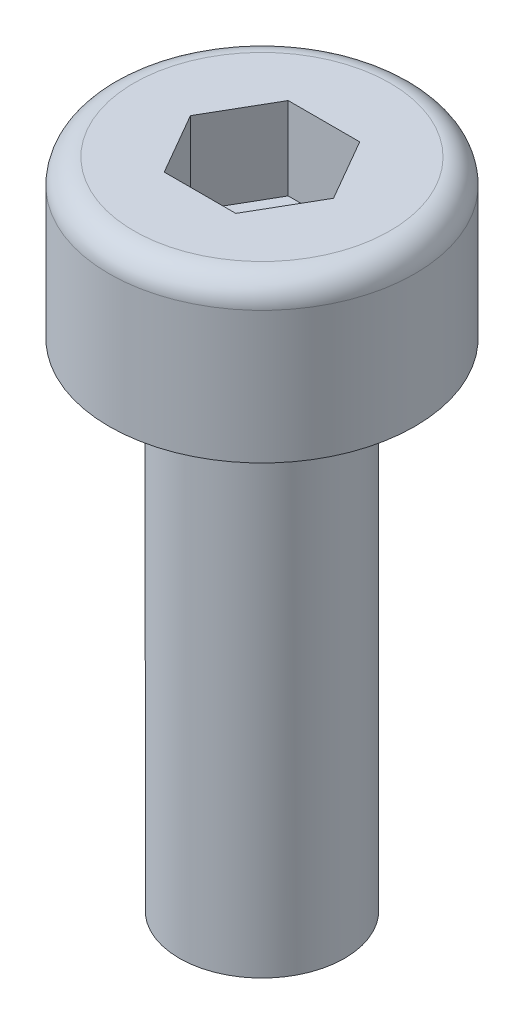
ISO-10303-21;
HEADER;
FILE_DESCRIPTION(('STEP AP214'),'2;1');
FILE_NAME('part.step','',(''),(''),'','','');
FILE_SCHEMA(('AUTOMOTIVE_DESIGN { 1 0 10303 214 1 1 1 1 }'));
ENDSEC;
DATA;
#1=APPLICATION_CONTEXT('core data for automotive mechanical design processes');
#2=APPLICATION_PROTOCOL_DEFINITION('international standard','automotive_design',2000,#1);
#3=PRODUCT_CONTEXT('',#1,'mechanical');
#4=PRODUCT('Part','Part','',(#3));
#5=PRODUCT_RELATED_PRODUCT_CATEGORY('part','',(#4));
#6=PRODUCT_DEFINITION_FORMATION('','',#4);
#7=PRODUCT_DEFINITION_CONTEXT('part definition',#1,'design');
#8=PRODUCT_DEFINITION('design','',#6,#7);
#9=PRODUCT_DEFINITION_SHAPE('','',#8);
#10=(LENGTH_UNIT() NAMED_UNIT(*) SI_UNIT(.MILLI.,.METRE.));
#11=(NAMED_UNIT(*) PLANE_ANGLE_UNIT() SI_UNIT($,.RADIAN.));
#12=(NAMED_UNIT(*) SI_UNIT($,.STERADIAN.) SOLID_ANGLE_UNIT());
#13=UNCERTAINTY_MEASURE_WITH_UNIT(LENGTH_MEASURE(1.E-05),#10,'distance_accuracy_value','');
#14=(GEOMETRIC_REPRESENTATION_CONTEXT(3) GLOBAL_UNCERTAINTY_ASSIGNED_CONTEXT((#13)) GLOBAL_UNIT_ASSIGNED_CONTEXT((#10,
#11,#12)) REPRESENTATION_CONTEXT('',''));
#15=CARTESIAN_POINT('',(0.,0.,0.));
#16=DIRECTION('',(0.,0.,1.));
#17=DIRECTION('',(1.,0.,0.));
#18=AXIS2_PLACEMENT_3D('',#15,#16,#17);
#19=CARTESIAN_POINT('',(0.,1.6,0.));
#20=DIRECTION('',(0.,-1.,0.));
#21=DIRECTION('',(0.,0.,-1.));
#22=AXIS2_PLACEMENT_3D('',#19,#20,#21);
#23=TOROIDAL_SURFACE('',#22,1.55,0.3);
#24=CARTESIAN_POINT('',(0.,1.9,0.));
#25=DIRECTION('',(0.,-1.,0.));
#26=DIRECTION('',(0.,0.,-1.));
#27=AXIS2_PLACEMENT_3D('',#24,#25,#26);
#28=CIRCLE('',#27,1.55);
#29=CARTESIAN_POINT('',(0.,1.9,-1.55));
#30=VERTEX_POINT('',#29);
#31=EDGE_CURVE('E131',#30,#30,#28,.T.);
#32=ORIENTED_EDGE('',*,*,#31,.T.);
#33=EDGE_LOOP('',(#32));
#34=FACE_BOUND('',#33,.T.);
#35=CARTESIAN_POINT('',(0.,1.6,0.));
#36=DIRECTION('',(0.,-1.,0.));
#37=DIRECTION('',(0.,0.,-1.));
#38=AXIS2_PLACEMENT_3D('',#35,#36,#37);
#39=CIRCLE('',#38,1.85);
#40=CARTESIAN_POINT('',(0.,1.6,-1.85));
#41=VERTEX_POINT('',#40);
#42=EDGE_CURVE('E11',#41,#41,#39,.T.);
#43=ORIENTED_EDGE('',*,*,#42,.F.);
#44=EDGE_LOOP('',(#43));
#45=FACE_BOUND('',#44,.T.);
#46=ADVANCED_FACE('F32',(#34,#45),#23,.T.);
#47=CARTESIAN_POINT('',(0.,1.9,0.));
#48=DIRECTION('',(0.,-1.,0.));
#49=DIRECTION('',(0.,0.,-1.));
#50=AXIS2_PLACEMENT_3D('',#47,#48,#49);
#51=CYLINDRICAL_SURFACE('',#50,1.85);
#52=ORIENTED_EDGE('',*,*,#42,.T.);
#53=EDGE_LOOP('',(#52));
#54=FACE_BOUND('',#53,.T.);
#55=CARTESIAN_POINT('',(0.,0.,0.));
#56=DIRECTION('',(0.,-1.,0.));
#57=DIRECTION('',(0.,0.,-1.));
#58=AXIS2_PLACEMENT_3D('',#55,#56,#57);
#59=CIRCLE('',#58,1.85);
#60=CARTESIAN_POINT('',(0.,0.,-1.85));
#61=VERTEX_POINT('',#60);
#62=EDGE_CURVE('E39',#61,#61,#59,.T.);
#63=ORIENTED_EDGE('',*,*,#62,.F.);
#64=EDGE_LOOP('',(#63));
#65=FACE_BOUND('',#64,.T.);
#66=ADVANCED_FACE('F152',(#54,#65),#51,.T.);
#67=CARTESIAN_POINT('',(1.85,0.,0.));
#68=DIRECTION('',(0.,-1.,0.));
#69=DIRECTION('',(0.,0.,-1.));
#70=AXIS2_PLACEMENT_3D('',#67,#68,#69);
#71=PLANE('',#70);
#72=ORIENTED_EDGE('',*,*,#62,.T.);
#73=EDGE_LOOP('',(#72));
#74=FACE_BOUND('',#73,.T.);
#75=CARTESIAN_POINT('',(0.,0.,0.));
#76=DIRECTION('',(0.,-1.,0.));
#77=DIRECTION('',(0.,0.,-1.));
#78=AXIS2_PLACEMENT_3D('',#75,#76,#77);
#79=CIRCLE('',#78,1.);
#80=CARTESIAN_POINT('',(0.,0.,-1.));
#81=VERTEX_POINT('',#80);
#82=EDGE_CURVE('E144',#81,#81,#79,.T.);
#83=ORIENTED_EDGE('',*,*,#82,.F.);
#84=EDGE_LOOP('',(#83));
#85=FACE_BOUND('',#84,.T.);
#86=ADVANCED_FACE('F149',(#74,#85),#71,.T.);
#87=CARTESIAN_POINT('',(0.,1.9,0.));
#88=DIRECTION('',(0.,-1.,0.));
#89=DIRECTION('',(0.,0.,-1.));
#90=AXIS2_PLACEMENT_3D('',#87,#88,#89);
#91=CYLINDRICAL_SURFACE('',#90,1.);
#92=ORIENTED_EDGE('',*,*,#82,.T.);
#93=EDGE_LOOP('',(#92));
#94=FACE_BOUND('',#93,.T.);
#95=CARTESIAN_POINT('',(0.,-6.,0.));
#96=DIRECTION('',(0.,-1.,0.));
#97=DIRECTION('',(0.,0.,-1.));
#98=AXIS2_PLACEMENT_3D('',#95,#96,#97);
#99=CIRCLE('',#98,1.);
#100=CARTESIAN_POINT('',(0.,-6.,-1.));
#101=VERTEX_POINT('',#100);
#102=EDGE_CURVE('E141',#101,#101,#99,.T.);
#103=ORIENTED_EDGE('',*,*,#102,.F.);
#104=EDGE_LOOP('',(#103));
#105=FACE_BOUND('',#104,.T.);
#106=ADVANCED_FACE('F159',(#94,#105),#91,.T.);
#107=CARTESIAN_POINT('',(0.,-6.26794919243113,0.));
#108=DIRECTION('',(0.,1.,0.));
#109=DIRECTION('',(0.,0.,1.));
#110=AXIS2_PLACEMENT_3D('',#107,#108,#109);
#111=CONICAL_SURFACE('',#110,0.,1.30899693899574);
#112=ORIENTED_EDGE('',*,*,#102,.T.);
#113=EDGE_LOOP('',(#112));
#114=FACE_BOUND('',#113,.T.);
#115=CARTESIAN_POINT('',(0.,-6.26794919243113,0.));
#116=VERTEX_POINT('',#115);
#117=VERTEX_LOOP('',#116);
#118=FACE_BOUND('',#117,.T.);
#119=ADVANCED_FACE('F165',(#114,#118),#111,.T.);
#120=CARTESIAN_POINT('',(0.,1.9,0.));
#121=DIRECTION('',(0.,1.,0.));
#122=DIRECTION('',(0.,0.,1.));
#123=AXIS2_PLACEMENT_3D('',#120,#121,#122);
#124=PLANE('',#123);
#125=DIRECTION('',(0.5,0.,-0.866025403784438));
#126=VECTOR('',#125,1.);
#127=CARTESIAN_POINT('',(0.433012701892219,1.9,0.75));
#128=LINE('',#127,#126);
#129=CARTESIAN_POINT('',(0.433012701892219,1.9,0.75));
#130=VERTEX_POINT('',#129);
#131=CARTESIAN_POINT('',(0.866025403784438,1.9,0.));
#132=VERTEX_POINT('',#131);
#133=EDGE_CURVE('E46',#130,#132,#128,.T.);
#134=ORIENTED_EDGE('',*,*,#133,.F.);
#135=DIRECTION('',(1.,0.,0.));
#136=VECTOR('',#135,1.);
#137=CARTESIAN_POINT('',(-0.43301270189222,1.9,0.75));
#138=LINE('',#137,#136);
#139=CARTESIAN_POINT('',(-0.43301270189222,1.9,0.75));
#140=VERTEX_POINT('',#139);
#141=EDGE_CURVE('E105',#140,#130,#138,.T.);
#142=ORIENTED_EDGE('',*,*,#141,.F.);
#143=DIRECTION('',(0.5,0.,0.866025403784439));
#144=VECTOR('',#143,1.);
#145=CARTESIAN_POINT('',(-0.866025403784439,1.9,0.));
#146=LINE('',#145,#144);
#147=CARTESIAN_POINT('',(-0.866025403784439,1.9,0.));
#148=VERTEX_POINT('',#147);
#149=EDGE_CURVE('E108',#148,#140,#146,.T.);
#150=ORIENTED_EDGE('',*,*,#149,.F.);
#151=DIRECTION('',(-0.5,0.,0.866025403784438));
#152=VECTOR('',#151,1.);
#153=CARTESIAN_POINT('',(-0.433012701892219,1.9,-0.75));
#154=LINE('',#153,#152);
#155=CARTESIAN_POINT('',(-0.433012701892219,1.9,-0.75));
#156=VERTEX_POINT('',#155);
#157=EDGE_CURVE('E124',#156,#148,#154,.T.);
#158=ORIENTED_EDGE('',*,*,#157,.F.);
#159=DIRECTION('',(-1.,0.,0.));
#160=VECTOR('',#159,1.);
#161=CARTESIAN_POINT('',(0.433012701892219,1.9,-0.75));
#162=LINE('',#161,#160);
#163=CARTESIAN_POINT('',(0.433012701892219,1.9,-0.75));
#164=VERTEX_POINT('',#163);
#165=EDGE_CURVE('E121',#164,#156,#162,.T.);
#166=ORIENTED_EDGE('',*,*,#165,.F.);
#167=DIRECTION('',(-0.5,0.,-0.866025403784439));
#168=VECTOR('',#167,1.);
#169=CARTESIAN_POINT('',(0.866025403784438,1.9,0.));
#170=LINE('',#169,#168);
#171=EDGE_CURVE('E119',#132,#164,#170,.T.);
#172=ORIENTED_EDGE('',*,*,#171,.F.);
#173=EDGE_LOOP('',(#134,#142,#150,#158,#166,#172));
#174=FACE_BOUND('',#173,.T.);
#175=ORIENTED_EDGE('',*,*,#31,.F.);
#176=EDGE_LOOP('',(#175));
#177=FACE_BOUND('',#176,.T.);
#178=ADVANCED_FACE('F169',(#174,#177),#124,.T.);
#179=CARTESIAN_POINT('',(0.433012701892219,0.9,0.75));
#180=DIRECTION('',(0.866025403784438,0.,0.5));
#181=DIRECTION('',(0.5,0.,-0.866025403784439));
#182=AXIS2_PLACEMENT_3D('',#179,#180,#181);
#183=PLANE('',#182);
#184=ORIENTED_EDGE('',*,*,#133,.T.);
#185=DIRECTION('',(0.,1.,0.));
#186=VECTOR('',#185,1.);
#187=CARTESIAN_POINT('',(0.866025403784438,0.9,0.));
#188=LINE('',#187,#186);
#189=CARTESIAN_POINT('',(0.866025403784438,0.9,0.));
#190=VERTEX_POINT('',#189);
#191=EDGE_CURVE('E82',#190,#132,#188,.T.);
#192=ORIENTED_EDGE('',*,*,#191,.F.);
#193=DIRECTION('',(0.5,0.,-0.866025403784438));
#194=VECTOR('',#193,1.);
#195=CARTESIAN_POINT('',(0.433012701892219,0.9,0.75));
#196=LINE('',#195,#194);
#197=CARTESIAN_POINT('',(0.433012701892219,0.9,0.75));
#198=VERTEX_POINT('',#197);
#199=EDGE_CURVE('E86',#198,#190,#196,.T.);
#200=ORIENTED_EDGE('',*,*,#199,.F.);
#201=DIRECTION('',(0.,1.,0.));
#202=VECTOR('',#201,1.);
#203=CARTESIAN_POINT('',(0.433012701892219,0.9,0.75));
#204=LINE('',#203,#202);
#205=EDGE_CURVE('E129',#198,#130,#204,.T.);
#206=ORIENTED_EDGE('',*,*,#205,.T.);
#207=EDGE_LOOP('',(#184,#192,#200,#206));
#208=FACE_BOUND('',#207,.T.);
#209=ADVANCED_FACE('F84',(#208),#183,.F.);
#210=CARTESIAN_POINT('',(-0.43301270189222,0.9,0.75));
#211=DIRECTION('',(0.,0.,1.));
#212=DIRECTION('',(1.,0.,0.));
#213=AXIS2_PLACEMENT_3D('',#210,#211,#212);
#214=PLANE('',#213);
#215=ORIENTED_EDGE('',*,*,#141,.T.);
#216=ORIENTED_EDGE('',*,*,#205,.F.);
#217=DIRECTION('',(1.,0.,0.));
#218=VECTOR('',#217,1.);
#219=CARTESIAN_POINT('',(-0.43301270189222,0.9,0.75));
#220=LINE('',#219,#218);
#221=CARTESIAN_POINT('',(-0.43301270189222,0.9,0.75));
#222=VERTEX_POINT('',#221);
#223=EDGE_CURVE('E92',#222,#198,#220,.T.);
#224=ORIENTED_EDGE('',*,*,#223,.F.);
#225=DIRECTION('',(0.,1.,0.));
#226=VECTOR('',#225,1.);
#227=CARTESIAN_POINT('',(-0.43301270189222,0.9,0.75));
#228=LINE('',#227,#226);
#229=EDGE_CURVE('E132',#222,#140,#228,.T.);
#230=ORIENTED_EDGE('',*,*,#229,.T.);
#231=EDGE_LOOP('',(#215,#216,#224,#230));
#232=FACE_BOUND('',#231,.T.);
#233=ADVANCED_FACE('F176',(#232),#214,.F.);
#234=CARTESIAN_POINT('',(-0.866025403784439,0.9,0.));
#235=DIRECTION('',(-0.866025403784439,0.,0.5));
#236=DIRECTION('',(0.5,0.,0.866025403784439));
#237=AXIS2_PLACEMENT_3D('',#234,#235,#236);
#238=PLANE('',#237);
#239=ORIENTED_EDGE('',*,*,#149,.T.);
#240=ORIENTED_EDGE('',*,*,#229,.F.);
#241=DIRECTION('',(0.5,0.,0.866025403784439));
#242=VECTOR('',#241,1.);
#243=CARTESIAN_POINT('',(-0.866025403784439,0.9,0.));
#244=LINE('',#243,#242);
#245=CARTESIAN_POINT('',(-0.866025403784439,0.9,0.));
#246=VERTEX_POINT('',#245);
#247=EDGE_CURVE('E115',#246,#222,#244,.T.);
#248=ORIENTED_EDGE('',*,*,#247,.F.);
#249=DIRECTION('',(0.,1.,0.));
#250=VECTOR('',#249,1.);
#251=CARTESIAN_POINT('',(-0.866025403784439,0.9,0.));
#252=LINE('',#251,#250);
#253=EDGE_CURVE('E134',#246,#148,#252,.T.);
#254=ORIENTED_EDGE('',*,*,#253,.T.);
#255=EDGE_LOOP('',(#239,#240,#248,#254));
#256=FACE_BOUND('',#255,.T.);
#257=ADVANCED_FACE('F186',(#256),#238,.F.);
#258=CARTESIAN_POINT('',(-0.433012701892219,0.9,-0.75));
#259=DIRECTION('',(-0.866025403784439,0.,-0.5));
#260=DIRECTION('',(-0.5,0.,0.866025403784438));
#261=AXIS2_PLACEMENT_3D('',#258,#259,#260);
#262=PLANE('',#261);
#263=ORIENTED_EDGE('',*,*,#157,.T.);
#264=ORIENTED_EDGE('',*,*,#253,.F.);
#265=DIRECTION('',(-0.5,0.,0.866025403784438));
#266=VECTOR('',#265,1.);
#267=CARTESIAN_POINT('',(-0.433012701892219,0.9,-0.75));
#268=LINE('',#267,#266);
#269=CARTESIAN_POINT('',(-0.433012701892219,0.9,-0.75));
#270=VERTEX_POINT('',#269);
#271=EDGE_CURVE('E112',#270,#246,#268,.T.);
#272=ORIENTED_EDGE('',*,*,#271,.F.);
#273=DIRECTION('',(0.,1.,0.));
#274=VECTOR('',#273,1.);
#275=CARTESIAN_POINT('',(-0.433012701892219,0.9,-0.75));
#276=LINE('',#275,#274);
#277=EDGE_CURVE('E136',#270,#156,#276,.T.);
#278=ORIENTED_EDGE('',*,*,#277,.T.);
#279=EDGE_LOOP('',(#263,#264,#272,#278));
#280=FACE_BOUND('',#279,.T.);
#281=ADVANCED_FACE('F182',(#280),#262,.F.);
#282=CARTESIAN_POINT('',(0.433012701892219,0.9,-0.75));
#283=DIRECTION('',(0.,0.,-1.));
#284=DIRECTION('',(-1.,0.,0.));
#285=AXIS2_PLACEMENT_3D('',#282,#283,#284);
#286=PLANE('',#285);
#287=ORIENTED_EDGE('',*,*,#165,.T.);
#288=ORIENTED_EDGE('',*,*,#277,.F.);
#289=DIRECTION('',(-1.,0.,0.));
#290=VECTOR('',#289,1.);
#291=CARTESIAN_POINT('',(0.433012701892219,0.9,-0.75));
#292=LINE('',#291,#290);
#293=CARTESIAN_POINT('',(0.433012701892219,0.9,-0.75));
#294=VERTEX_POINT('',#293);
#295=EDGE_CURVE('E100',#294,#270,#292,.T.);
#296=ORIENTED_EDGE('',*,*,#295,.F.);
#297=DIRECTION('',(0.,1.,0.));
#298=VECTOR('',#297,1.);
#299=CARTESIAN_POINT('',(0.433012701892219,0.9,-0.75));
#300=LINE('',#299,#298);
#301=EDGE_CURVE('E91',#294,#164,#300,.T.);
#302=ORIENTED_EDGE('',*,*,#301,.T.);
#303=EDGE_LOOP('',(#287,#288,#296,#302));
#304=FACE_BOUND('',#303,.T.);
#305=ADVANCED_FACE('F179',(#304),#286,.F.);
#306=CARTESIAN_POINT('',(0.866025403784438,0.9,0.));
#307=DIRECTION('',(0.866025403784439,0.,-0.5));
#308=DIRECTION('',(-0.5,0.,-0.866025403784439));
#309=AXIS2_PLACEMENT_3D('',#306,#307,#308);
#310=PLANE('',#309);
#311=ORIENTED_EDGE('',*,*,#171,.T.);
#312=ORIENTED_EDGE('',*,*,#301,.F.);
#313=DIRECTION('',(-0.5,0.,-0.866025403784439));
#314=VECTOR('',#313,1.);
#315=CARTESIAN_POINT('',(0.866025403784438,0.9,0.));
#316=LINE('',#315,#314);
#317=EDGE_CURVE('E95',#190,#294,#316,.T.);
#318=ORIENTED_EDGE('',*,*,#317,.F.);
#319=ORIENTED_EDGE('',*,*,#191,.T.);
#320=EDGE_LOOP('',(#311,#312,#318,#319));
#321=FACE_BOUND('',#320,.T.);
#322=ADVANCED_FACE('F96',(#321),#310,.F.);
#323=CARTESIAN_POINT('',(0.433012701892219,0.9,0.75));
#324=DIRECTION('',(0.,-1.,0.));
#325=DIRECTION('',(0.,0.,-1.));
#326=AXIS2_PLACEMENT_3D('',#323,#324,#325);
#327=PLANE('',#326);
#328=ORIENTED_EDGE('',*,*,#199,.T.);
#329=ORIENTED_EDGE('',*,*,#317,.T.);
#330=ORIENTED_EDGE('',*,*,#295,.T.);
#331=ORIENTED_EDGE('',*,*,#271,.T.);
#332=ORIENTED_EDGE('',*,*,#247,.T.);
#333=ORIENTED_EDGE('',*,*,#223,.T.);
#334=EDGE_LOOP('',(#328,#329,#330,#331,#332,#333));
#335=FACE_BOUND('',#334,.T.);
#336=ADVANCED_FACE('F102',(#335),#327,.F.);
#337=CLOSED_SHELL('',(#46,#66,#86,#106,#119,#178,#209,#233,#257,#281,#305,#322,#336));
#338=MANIFOLD_SOLID_BREP('B2',#337);
#339=ADVANCED_BREP_SHAPE_REPRESENTATION('',(#18,#338),#14);
#340=SHAPE_DEFINITION_REPRESENTATION(#9,#339);
ENDSEC;
END-ISO-10303-21;
